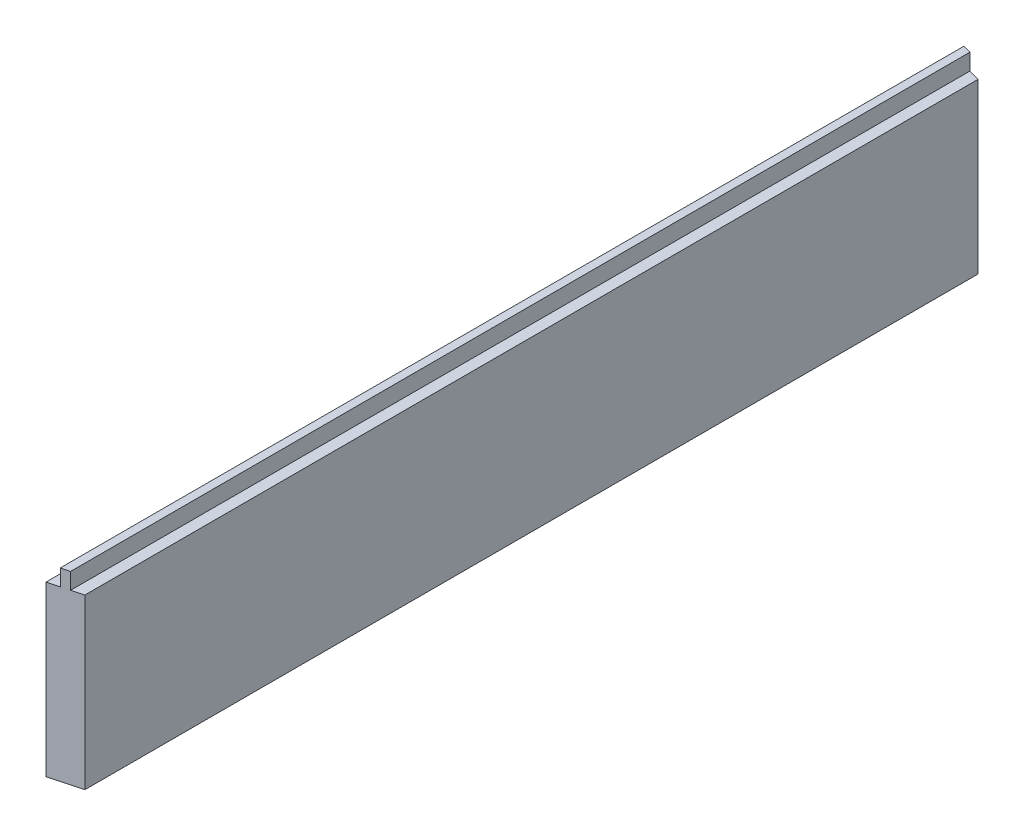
from build123d import *

# Parameters (mm, degrees)
ESQUISSE1_W                  = 4
ESQUISSE1_H                  = 8
ESQUISSE1_H_2                = 6
BOSS_EXTRU_1_DEPTH           = 445
ENL_V_MAT_EXTRU_1_DEPTH      = 448.779870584
ENL_V_MAT_EXTRU_1_DEPTH_BACK = 448.779870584


with BuildPart() as part:
    # Esquisse1 → Boss.-Extru.1 (new body)
    with BuildSketch(Plane.XY):
        Polygon((2, -41.25), (7.5, -41.25), (7.5, 41.25), (2, 41.25), (2, 33.25), (-2, 33.25), (-2, 41.25), (-7.5, 41.25), (-7.5, -41.25), (-2, -41.25), (-2, -35.25), (2, -35.25), align=None)
        with Locations((0, 37.25)):
            Rectangle(ESQUISSE1_W, ESQUISSE1_H)
        with Locations((0, 45.25)):
            Rectangle(ESQUISSE1_W, ESQUISSE1_H)
        with Locations((0, -38.25)):
            Rectangle(ESQUISSE1_W, ESQUISSE1_H_2)
    extrude(amount=BOSS_EXTRU_1_DEPTH)

    # Esquisse2 → Enl_v. mat.-Extru.1 (cut, two sides: drawn at the far end of the back side and taken through both)
    with BuildSketch(Plane(origin=(0, 0, 0), x_dir=(1, 0, 0), z_dir=(0, 1, 0)).offset(-ENL_V_MAT_EXTRU_1_DEPTH_BACK)):
        Polygon((-7.5, 0), (7.5, 0), (7.5, -4.019237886), align=None)
        Polygon((-7.5, -445), (7.5, -445), (7.5, -440.980762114), align=None)
    extrude(amount=ENL_V_MAT_EXTRU_1_DEPTH + ENL_V_MAT_EXTRU_1_DEPTH_BACK, mode=Mode.SUBTRACT)


solid = part.part
